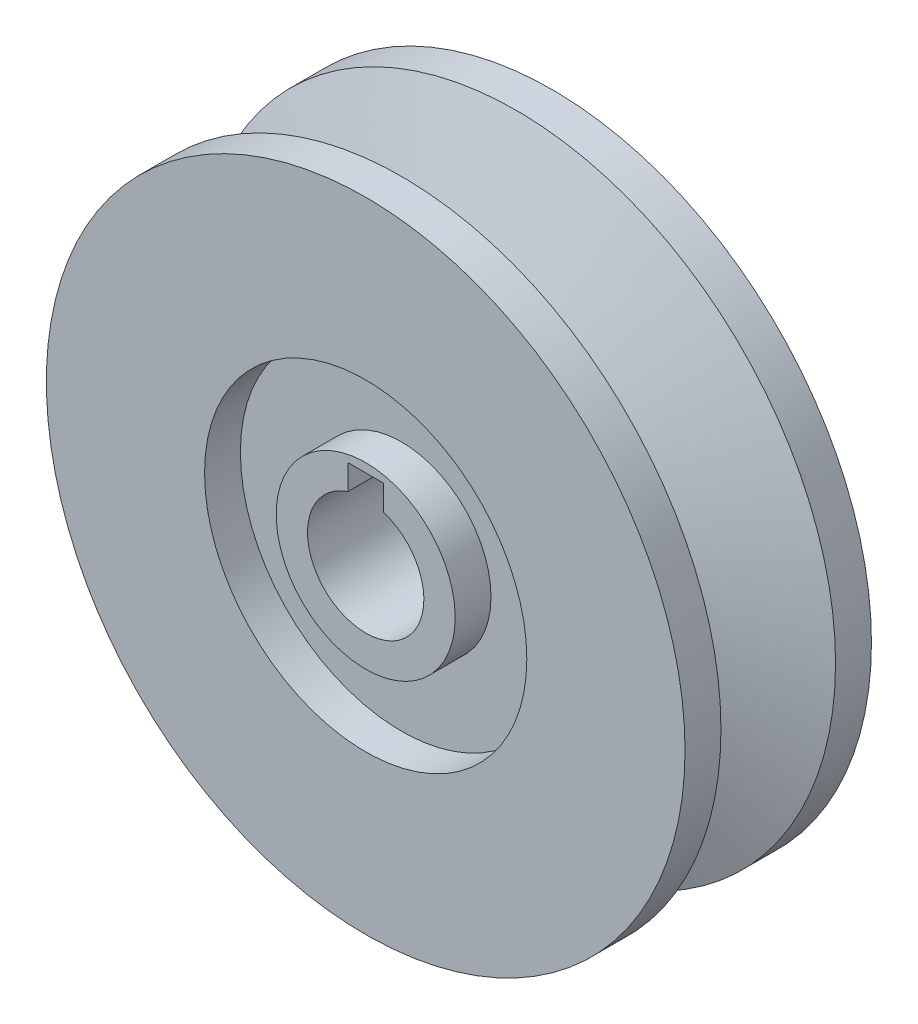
ISO-10303-21;
HEADER;
FILE_DESCRIPTION(('STEP AP214'),'2;1');
FILE_NAME('part.step','',(''),(''),'','','');
FILE_SCHEMA(('AUTOMOTIVE_DESIGN { 1 0 10303 214 1 1 1 1 }'));
ENDSEC;
DATA;
#1=APPLICATION_CONTEXT('core data for automotive mechanical design processes');
#2=APPLICATION_PROTOCOL_DEFINITION('international standard','automotive_design',2000,#1);
#3=PRODUCT_CONTEXT('',#1,'mechanical');
#4=PRODUCT('Part','Part','',(#3));
#5=PRODUCT_RELATED_PRODUCT_CATEGORY('part','',(#4));
#6=PRODUCT_DEFINITION_FORMATION('','',#4);
#7=PRODUCT_DEFINITION_CONTEXT('part definition',#1,'design');
#8=PRODUCT_DEFINITION('design','',#6,#7);
#9=PRODUCT_DEFINITION_SHAPE('','',#8);
#10=(LENGTH_UNIT() NAMED_UNIT(*) SI_UNIT(.MILLI.,.METRE.));
#11=(NAMED_UNIT(*) PLANE_ANGLE_UNIT() SI_UNIT($,.RADIAN.));
#12=(NAMED_UNIT(*) SI_UNIT($,.STERADIAN.) SOLID_ANGLE_UNIT());
#13=UNCERTAINTY_MEASURE_WITH_UNIT(LENGTH_MEASURE(1.E-05),#10,'distance_accuracy_value','');
#14=(GEOMETRIC_REPRESENTATION_CONTEXT(3) GLOBAL_UNCERTAINTY_ASSIGNED_CONTEXT((#13)) GLOBAL_UNIT_ASSIGNED_CONTEXT((#10,
#11,#12)) REPRESENTATION_CONTEXT('',''));
#15=CARTESIAN_POINT('',(0.,0.,0.));
#16=DIRECTION('',(0.,0.,1.));
#17=DIRECTION('',(1.,0.,0.));
#18=AXIS2_PLACEMENT_3D('',#15,#16,#17);
#19=CARTESIAN_POINT('',(0.,35.6749992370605,10.4139995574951));
#20=DIRECTION('',(0.,0.,-1.));
#21=DIRECTION('',(-1.,0.,0.));
#22=AXIS2_PLACEMENT_3D('',#19,#20,#21);
#23=PLANE('',#22);
#24=DIRECTION('',(0.,1.,0.));
#25=VECTOR('',#24,1.);
#26=CARTESIAN_POINT('',(-2.,9.00000000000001,10.4139995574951));
#27=LINE('',#26,#25);
#28=CARTESIAN_POINT('',(-2.,6.18465843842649,10.4139995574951));
#29=VERTEX_POINT('',#28);
#30=CARTESIAN_POINT('',(-2.,9.00000000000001,10.4139995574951));
#31=VERTEX_POINT('',#30);
#32=EDGE_CURVE('E80',#29,#31,#27,.T.);
#33=ORIENTED_EDGE('',*,*,#32,.T.);
#34=DIRECTION('',(1.,0.,0.));
#35=VECTOR('',#34,1.);
#36=CARTESIAN_POINT('',(2.,9.00000000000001,10.4139995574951));
#37=LINE('',#36,#35);
#38=CARTESIAN_POINT('',(2.,9.00000000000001,10.4139995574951));
#39=VERTEX_POINT('',#38);
#40=EDGE_CURVE('E74',#31,#39,#37,.T.);
#41=ORIENTED_EDGE('',*,*,#40,.T.);
#42=DIRECTION('',(0.,-1.,0.));
#43=VECTOR('',#42,1.);
#44=CARTESIAN_POINT('',(2.,9.00000000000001,10.4139995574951));
#45=LINE('',#44,#43);
#46=CARTESIAN_POINT('',(2.,6.18465843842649,10.4139995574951));
#47=VERTEX_POINT('',#46);
#48=EDGE_CURVE('E83',#39,#47,#45,.T.);
#49=ORIENTED_EDGE('',*,*,#48,.T.);
#50=CARTESIAN_POINT('',(0.,0.,10.4139995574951));
#51=DIRECTION('',(0.,0.,-1.));
#52=DIRECTION('',(-1.,0.,0.));
#53=AXIS2_PLACEMENT_3D('',#50,#51,#52);
#54=CIRCLE('',#53,6.5);
#55=EDGE_CURVE('E54',#47,#29,#54,.T.);
#56=ORIENTED_EDGE('',*,*,#55,.T.);
#57=EDGE_LOOP('',(#33,#41,#49,#56));
#58=FACE_BOUND('',#57,.T.);
#59=CARTESIAN_POINT('',(0.,0.,10.4139995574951));
#60=DIRECTION('',(0.,0.,1.));
#61=DIRECTION('',(1.,0.,0.));
#62=AXIS2_PLACEMENT_3D('',#59,#60,#61);
#63=CIRCLE('',#62,10.);
#64=CARTESIAN_POINT('',(10.,0.,10.4139995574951));
#65=VERTEX_POINT('',#64);
#66=EDGE_CURVE('E315',#65,#65,#63,.T.);
#67=ORIENTED_EDGE('',*,*,#66,.T.);
#68=EDGE_LOOP('',(#67));
#69=FACE_BOUND('',#68,.T.);
#70=ADVANCED_FACE('F31',(#58,#69),#23,.F.);
#71=CARTESIAN_POINT('',(0.,0.,-10.4139995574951));
#72=DIRECTION('',(0.,0.,1.));
#73=DIRECTION('',(1.,0.,0.));
#74=AXIS2_PLACEMENT_3D('',#71,#72,#73);
#75=PLANE('',#74);
#76=DIRECTION('',(0.,-1.,0.));
#77=VECTOR('',#76,1.);
#78=CARTESIAN_POINT('',(2.,9.00000000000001,-10.4139995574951));
#79=LINE('',#78,#77);
#80=CARTESIAN_POINT('',(2.,9.00000000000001,-10.4139995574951));
#81=VERTEX_POINT('',#80);
#82=CARTESIAN_POINT('',(2.,6.18465843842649,-10.4139995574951));
#83=VERTEX_POINT('',#82);
#84=EDGE_CURVE('E101',#81,#83,#79,.T.);
#85=ORIENTED_EDGE('',*,*,#84,.F.);
#86=DIRECTION('',(1.,0.,0.));
#87=VECTOR('',#86,1.);
#88=CARTESIAN_POINT('',(2.,9.00000000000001,-10.4139995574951));
#89=LINE('',#88,#87);
#90=CARTESIAN_POINT('',(-2.,9.00000000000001,-10.4139995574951));
#91=VERTEX_POINT('',#90);
#92=EDGE_CURVE('E46',#91,#81,#89,.T.);
#93=ORIENTED_EDGE('',*,*,#92,.F.);
#94=DIRECTION('',(0.,1.,0.));
#95=VECTOR('',#94,1.);
#96=CARTESIAN_POINT('',(-2.,9.00000000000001,-10.4139995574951));
#97=LINE('',#96,#95);
#98=CARTESIAN_POINT('',(-2.,6.18465843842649,-10.4139995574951));
#99=VERTEX_POINT('',#98);
#100=EDGE_CURVE('E89',#99,#91,#97,.T.);
#101=ORIENTED_EDGE('',*,*,#100,.F.);
#102=CARTESIAN_POINT('',(0.,0.,-10.4139995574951));
#103=DIRECTION('',(0.,0.,-1.));
#104=DIRECTION('',(-1.,0.,0.));
#105=AXIS2_PLACEMENT_3D('',#102,#103,#104);
#106=CIRCLE('',#105,6.5);
#107=EDGE_CURVE('E92',#83,#99,#106,.T.);
#108=ORIENTED_EDGE('',*,*,#107,.F.);
#109=EDGE_LOOP('',(#85,#93,#101,#108));
#110=FACE_BOUND('',#109,.T.);
#111=CARTESIAN_POINT('',(0.,0.,-10.4139995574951));
#112=DIRECTION('',(0.,0.,-1.));
#113=DIRECTION('',(-1.,0.,0.));
#114=AXIS2_PLACEMENT_3D('',#111,#112,#113);
#115=CIRCLE('',#114,10.);
#116=CARTESIAN_POINT('',(-10.,0.,-10.4139995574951));
#117=VERTEX_POINT('',#116);
#118=EDGE_CURVE('E322',#117,#117,#115,.T.);
#119=ORIENTED_EDGE('',*,*,#118,.T.);
#120=EDGE_LOOP('',(#119));
#121=FACE_BOUND('',#120,.T.);
#122=ADVANCED_FACE('F133',(#110,#121),#75,.F.);
#123=CARTESIAN_POINT('',(0.,0.,-10.4139995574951));
#124=DIRECTION('',(0.,0.,-1.));
#125=DIRECTION('',(-1.,0.,0.));
#126=AXIS2_PLACEMENT_3D('',#123,#124,#125);
#127=CIRCLE('',#126,18.);
#128=CARTESIAN_POINT('',(-18.,0.,-10.4139995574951));
#129=VERTEX_POINT('',#128);
#130=EDGE_CURVE('E95',#129,#129,#127,.T.);
#131=ORIENTED_EDGE('',*,*,#130,.F.);
#132=EDGE_LOOP('',(#131));
#133=FACE_BOUND('',#132,.T.);
#134=CARTESIAN_POINT('',(0.,0.,-10.4139995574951));
#135=DIRECTION('',(0.,0.,1.));
#136=DIRECTION('',(1.,0.,0.));
#137=AXIS2_PLACEMENT_3D('',#134,#135,#136);
#138=CIRCLE('',#137,35.6749992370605);
#139=CARTESIAN_POINT('',(35.6749992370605,0.,-10.4139995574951));
#140=VERTEX_POINT('',#139);
#141=EDGE_CURVE('E11',#140,#140,#138,.T.);
#142=ORIENTED_EDGE('',*,*,#141,.F.);
#143=EDGE_LOOP('',(#142));
#144=FACE_BOUND('',#143,.T.);
#145=ADVANCED_FACE('F33',(#133,#144),#75,.F.);
#146=CARTESIAN_POINT('',(0.,0.,20.8279991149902));
#147=DIRECTION('',(0.,0.,1.));
#148=DIRECTION('',(1.,0.,0.));
#149=AXIS2_PLACEMENT_3D('',#146,#147,#148);
#150=CYLINDRICAL_SURFACE('',#149,35.6749992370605);
#151=CARTESIAN_POINT('',(0.,0.,-6.4008002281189));
#152=DIRECTION('',(0.,0.,1.));
#153=DIRECTION('',(1.,0.,0.));
#154=AXIS2_PLACEMENT_3D('',#151,#152,#153);
#155=CIRCLE('',#154,35.6749992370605);
#156=CARTESIAN_POINT('',(35.6749992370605,0.,-6.4008002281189));
#157=VERTEX_POINT('',#156);
#158=EDGE_CURVE('E39',#157,#157,#155,.T.);
#159=ORIENTED_EDGE('',*,*,#158,.F.);
#160=EDGE_LOOP('',(#159));
#161=FACE_BOUND('',#160,.T.);
#162=ORIENTED_EDGE('',*,*,#141,.T.);
#163=EDGE_LOOP('',(#162));
#164=FACE_BOUND('',#163,.T.);
#165=ADVANCED_FACE('F127',(#161,#164),#150,.T.);
#166=CARTESIAN_POINT('',(0.,0.,-6.4008002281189));
#167=DIRECTION('',(0.,0.,-1.));
#168=DIRECTION('',(-1.,0.,0.));
#169=AXIS2_PLACEMENT_3D('',#166,#167,#168);
#170=CONICAL_SURFACE('',#169,35.6749992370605,1.23918377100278);
#171=CARTESIAN_POINT('',(0.,0.,-2.11529874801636));
#172=DIRECTION('',(0.,0.,1.));
#173=DIRECTION('',(1.,0.,0.));
#174=AXIS2_PLACEMENT_3D('',#171,#172,#173);
#175=CIRCLE('',#174,23.2289991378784);
#176=CARTESIAN_POINT('',(23.2289991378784,0.,-2.11529874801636));
#177=VERTEX_POINT('',#176);
#178=EDGE_CURVE('E120',#177,#177,#175,.T.);
#179=ORIENTED_EDGE('',*,*,#178,.F.);
#180=EDGE_LOOP('',(#179));
#181=FACE_BOUND('',#180,.T.);
#182=ORIENTED_EDGE('',*,*,#158,.T.);
#183=EDGE_LOOP('',(#182));
#184=FACE_BOUND('',#183,.T.);
#185=ADVANCED_FACE('F125',(#181,#184),#170,.T.);
#186=CARTESIAN_POINT('',(0.,0.,20.8279991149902));
#187=DIRECTION('',(0.,0.,1.));
#188=DIRECTION('',(1.,0.,0.));
#189=AXIS2_PLACEMENT_3D('',#186,#187,#188);
#190=CYLINDRICAL_SURFACE('',#189,23.2289991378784);
#191=CARTESIAN_POINT('',(0.,0.,2.11529874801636));
#192=DIRECTION('',(0.,0.,1.));
#193=DIRECTION('',(1.,0.,0.));
#194=AXIS2_PLACEMENT_3D('',#191,#192,#193);
#195=CIRCLE('',#194,23.2289991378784);
#196=CARTESIAN_POINT('',(23.2289991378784,0.,2.11529874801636));
#197=VERTEX_POINT('',#196);
#198=EDGE_CURVE('E117',#197,#197,#195,.T.);
#199=ORIENTED_EDGE('',*,*,#198,.F.);
#200=EDGE_LOOP('',(#199));
#201=FACE_BOUND('',#200,.T.);
#202=ORIENTED_EDGE('',*,*,#178,.T.);
#203=EDGE_LOOP('',(#202));
#204=FACE_BOUND('',#203,.T.);
#205=ADVANCED_FACE('F167',(#201,#204),#190,.T.);
#206=CARTESIAN_POINT('',(0.,0.,2.11529874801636));
#207=DIRECTION('',(0.,0.,1.));
#208=DIRECTION('',(1.,0.,0.));
#209=AXIS2_PLACEMENT_3D('',#206,#207,#208);
#210=CONICAL_SURFACE('',#209,23.2289991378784,1.23918377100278);
#211=CARTESIAN_POINT('',(0.,0.,6.4008002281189));
#212=DIRECTION('',(0.,0.,1.));
#213=DIRECTION('',(1.,0.,0.));
#214=AXIS2_PLACEMENT_3D('',#211,#212,#213);
#215=CIRCLE('',#214,35.6749992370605);
#216=CARTESIAN_POINT('',(35.6749992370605,0.,6.4008002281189));
#217=VERTEX_POINT('',#216);
#218=EDGE_CURVE('E114',#217,#217,#215,.T.);
#219=ORIENTED_EDGE('',*,*,#218,.F.);
#220=EDGE_LOOP('',(#219));
#221=FACE_BOUND('',#220,.T.);
#222=ORIENTED_EDGE('',*,*,#198,.T.);
#223=EDGE_LOOP('',(#222));
#224=FACE_BOUND('',#223,.T.);
#225=ADVANCED_FACE('F155',(#221,#224),#210,.T.);
#226=CARTESIAN_POINT('',(0.,0.,20.8279991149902));
#227=DIRECTION('',(0.,0.,1.));
#228=DIRECTION('',(1.,0.,0.));
#229=AXIS2_PLACEMENT_3D('',#226,#227,#228);
#230=CYLINDRICAL_SURFACE('',#229,35.6749992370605);
#231=CARTESIAN_POINT('',(0.,0.,10.4139995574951));
#232=DIRECTION('',(0.,0.,1.));
#233=DIRECTION('',(1.,0.,0.));
#234=AXIS2_PLACEMENT_3D('',#231,#232,#233);
#235=CIRCLE('',#234,35.6749992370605);
#236=CARTESIAN_POINT('',(35.6749992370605,0.,10.4139995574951));
#237=VERTEX_POINT('',#236);
#238=EDGE_CURVE('E108',#237,#237,#235,.T.);
#239=ORIENTED_EDGE('',*,*,#238,.F.);
#240=EDGE_LOOP('',(#239));
#241=FACE_BOUND('',#240,.T.);
#242=ORIENTED_EDGE('',*,*,#218,.T.);
#243=EDGE_LOOP('',(#242));
#244=FACE_BOUND('',#243,.T.);
#245=ADVANCED_FACE('F148',(#241,#244),#230,.T.);
#246=CARTESIAN_POINT('',(0.,0.,10.4139995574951));
#247=DIRECTION('',(0.,0.,1.));
#248=DIRECTION('',(1.,0.,0.));
#249=AXIS2_PLACEMENT_3D('',#246,#247,#248);
#250=CIRCLE('',#249,18.);
#251=CARTESIAN_POINT('',(18.,0.,10.4139995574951));
#252=VERTEX_POINT('',#251);
#253=EDGE_CURVE('E160',#252,#252,#250,.T.);
#254=ORIENTED_EDGE('',*,*,#253,.F.);
#255=EDGE_LOOP('',(#254));
#256=FACE_BOUND('',#255,.T.);
#257=ORIENTED_EDGE('',*,*,#238,.T.);
#258=EDGE_LOOP('',(#257));
#259=FACE_BOUND('',#258,.T.);
#260=ADVANCED_FACE('F142',(#256,#259),#23,.F.);
#261=CARTESIAN_POINT('',(2.,9.00000000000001,10.4139995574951));
#262=DIRECTION('',(0.,1.,0.));
#263=DIRECTION('',(0.,0.,1.));
#264=AXIS2_PLACEMENT_3D('',#261,#262,#263);
#265=PLANE('',#264);
#266=ORIENTED_EDGE('',*,*,#92,.T.);
#267=DIRECTION('',(0.,0.,-1.));
#268=VECTOR('',#267,1.);
#269=CARTESIAN_POINT('',(2.,9.00000000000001,10.4139995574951));
#270=LINE('',#269,#268);
#271=EDGE_CURVE('E70',#39,#81,#270,.T.);
#272=ORIENTED_EDGE('',*,*,#271,.F.);
#273=ORIENTED_EDGE('',*,*,#40,.F.);
#274=DIRECTION('',(0.,0.,-1.));
#275=VECTOR('',#274,1.);
#276=CARTESIAN_POINT('',(-2.,9.00000000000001,10.4139995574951));
#277=LINE('',#276,#275);
#278=EDGE_CURVE('E106',#31,#91,#277,.T.);
#279=ORIENTED_EDGE('',*,*,#278,.T.);
#280=EDGE_LOOP('',(#266,#272,#273,#279));
#281=FACE_BOUND('',#280,.T.);
#282=ADVANCED_FACE('F72',(#281),#265,.F.);
#283=CARTESIAN_POINT('',(-2.,9.00000000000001,10.4139995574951));
#284=DIRECTION('',(-1.,0.,0.));
#285=DIRECTION('',(0.,0.,1.));
#286=AXIS2_PLACEMENT_3D('',#283,#284,#285);
#287=PLANE('',#286);
#288=ORIENTED_EDGE('',*,*,#100,.T.);
#289=ORIENTED_EDGE('',*,*,#278,.F.);
#290=ORIENTED_EDGE('',*,*,#32,.F.);
#291=DIRECTION('',(0.,0.,-1.));
#292=VECTOR('',#291,1.);
#293=CARTESIAN_POINT('',(-2.,6.18465843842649,10.4139995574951));
#294=LINE('',#293,#292);
#295=EDGE_CURVE('E109',#29,#99,#294,.T.);
#296=ORIENTED_EDGE('',*,*,#295,.T.);
#297=EDGE_LOOP('',(#288,#289,#290,#296));
#298=FACE_BOUND('',#297,.T.);
#299=ADVANCED_FACE('F154',(#298),#287,.F.);
#300=CARTESIAN_POINT('',(0.,0.,10.4139995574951));
#301=DIRECTION('',(0.,0.,-1.));
#302=DIRECTION('',(-1.,0.,0.));
#303=AXIS2_PLACEMENT_3D('',#300,#301,#302);
#304=CYLINDRICAL_SURFACE('',#303,6.5);
#305=ORIENTED_EDGE('',*,*,#107,.T.);
#306=ORIENTED_EDGE('',*,*,#295,.F.);
#307=ORIENTED_EDGE('',*,*,#55,.F.);
#308=DIRECTION('',(0.,0.,-1.));
#309=VECTOR('',#308,1.);
#310=CARTESIAN_POINT('',(2.,6.18465843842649,10.4139995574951));
#311=LINE('',#310,#309);
#312=EDGE_CURVE('E79',#47,#83,#311,.T.);
#313=ORIENTED_EDGE('',*,*,#312,.T.);
#314=EDGE_LOOP('',(#305,#306,#307,#313));
#315=FACE_BOUND('',#314,.T.);
#316=ADVANCED_FACE('F210',(#315),#304,.F.);
#317=CARTESIAN_POINT('',(2.,9.00000000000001,10.4139995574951));
#318=DIRECTION('',(1.,0.,0.));
#319=DIRECTION('',(0.,0.,-1.));
#320=AXIS2_PLACEMENT_3D('',#317,#318,#319);
#321=PLANE('',#320);
#322=ORIENTED_EDGE('',*,*,#84,.T.);
#323=ORIENTED_EDGE('',*,*,#312,.F.);
#324=ORIENTED_EDGE('',*,*,#48,.F.);
#325=ORIENTED_EDGE('',*,*,#271,.T.);
#326=EDGE_LOOP('',(#322,#323,#324,#325));
#327=FACE_BOUND('',#326,.T.);
#328=ADVANCED_FACE('F84',(#327),#321,.F.);
#329=CARTESIAN_POINT('',(0.,0.,-6.41399955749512));
#330=DIRECTION('',(0.,0.,-1.));
#331=DIRECTION('',(-1.,0.,0.));
#332=AXIS2_PLACEMENT_3D('',#329,#330,#331);
#333=CYLINDRICAL_SURFACE('',#332,18.);
#334=CARTESIAN_POINT('',(0.,0.,-6.41399955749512));
#335=DIRECTION('',(0.,0.,-1.));
#336=DIRECTION('',(-1.,0.,0.));
#337=AXIS2_PLACEMENT_3D('',#334,#335,#336);
#338=CIRCLE('',#337,18.);
#339=CARTESIAN_POINT('',(-18.,0.,-6.41399955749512));
#340=VERTEX_POINT('',#339);
#341=EDGE_CURVE('E102',#340,#340,#338,.T.);
#342=ORIENTED_EDGE('',*,*,#341,.F.);
#343=EDGE_LOOP('',(#342));
#344=FACE_BOUND('',#343,.T.);
#345=ORIENTED_EDGE('',*,*,#130,.T.);
#346=EDGE_LOOP('',(#345));
#347=FACE_BOUND('',#346,.T.);
#348=ADVANCED_FACE('F228',(#344,#347),#333,.F.);
#349=CARTESIAN_POINT('',(0.,0.,-6.41399955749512));
#350=DIRECTION('',(0.,0.,-1.));
#351=DIRECTION('',(-1.,0.,0.));
#352=AXIS2_PLACEMENT_3D('',#349,#350,#351);
#353=PLANE('',#352);
#354=CARTESIAN_POINT('',(0.,0.,-6.41399955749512));
#355=DIRECTION('',(0.,0.,-1.));
#356=DIRECTION('',(-1.,0.,0.));
#357=AXIS2_PLACEMENT_3D('',#354,#355,#356);
#358=CIRCLE('',#357,10.);
#359=CARTESIAN_POINT('',(-10.,0.,-6.41399955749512));
#360=VERTEX_POINT('',#359);
#361=EDGE_CURVE('E324',#360,#360,#358,.T.);
#362=ORIENTED_EDGE('',*,*,#361,.F.);
#363=EDGE_LOOP('',(#362));
#364=FACE_BOUND('',#363,.T.);
#365=ORIENTED_EDGE('',*,*,#341,.T.);
#366=EDGE_LOOP('',(#365));
#367=FACE_BOUND('',#366,.T.);
#368=ADVANCED_FACE('F248',(#364,#367),#353,.T.);
#369=CARTESIAN_POINT('',(0.,0.,-6.41399955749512));
#370=DIRECTION('',(0.,0.,-1.));
#371=DIRECTION('',(-1.,0.,0.));
#372=AXIS2_PLACEMENT_3D('',#369,#370,#371);
#373=CYLINDRICAL_SURFACE('',#372,10.);
#374=ORIENTED_EDGE('',*,*,#361,.T.);
#375=EDGE_LOOP('',(#374));
#376=FACE_BOUND('',#375,.T.);
#377=ORIENTED_EDGE('',*,*,#118,.F.);
#378=EDGE_LOOP('',(#377));
#379=FACE_BOUND('',#378,.T.);
#380=ADVANCED_FACE('F258',(#376,#379),#373,.T.);
#381=CARTESIAN_POINT('',(0.,0.,6.41399955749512));
#382=DIRECTION('',(0.,0.,1.));
#383=DIRECTION('',(1.,0.,0.));
#384=AXIS2_PLACEMENT_3D('',#381,#382,#383);
#385=CYLINDRICAL_SURFACE('',#384,18.);
#386=CARTESIAN_POINT('',(0.,0.,6.41399955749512));
#387=DIRECTION('',(0.,0.,1.));
#388=DIRECTION('',(1.,0.,0.));
#389=AXIS2_PLACEMENT_3D('',#386,#387,#388);
#390=CIRCLE('',#389,18.);
#391=CARTESIAN_POINT('',(18.,0.,6.41399955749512));
#392=VERTEX_POINT('',#391);
#393=EDGE_CURVE('E319',#392,#392,#390,.T.);
#394=ORIENTED_EDGE('',*,*,#393,.F.);
#395=EDGE_LOOP('',(#394));
#396=FACE_BOUND('',#395,.T.);
#397=ORIENTED_EDGE('',*,*,#253,.T.);
#398=EDGE_LOOP('',(#397));
#399=FACE_BOUND('',#398,.T.);
#400=ADVANCED_FACE('F267',(#396,#399),#385,.F.);
#401=CARTESIAN_POINT('',(0.,0.,6.41399955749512));
#402=DIRECTION('',(0.,0.,1.));
#403=DIRECTION('',(1.,0.,0.));
#404=AXIS2_PLACEMENT_3D('',#401,#402,#403);
#405=PLANE('',#404);
#406=CARTESIAN_POINT('',(0.,0.,6.41399955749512));
#407=DIRECTION('',(0.,0.,1.));
#408=DIRECTION('',(1.,0.,0.));
#409=AXIS2_PLACEMENT_3D('',#406,#407,#408);
#410=CIRCLE('',#409,10.);
#411=CARTESIAN_POINT('',(10.,0.,6.41399955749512));
#412=VERTEX_POINT('',#411);
#413=EDGE_CURVE('E312',#412,#412,#410,.T.);
#414=ORIENTED_EDGE('',*,*,#413,.F.);
#415=EDGE_LOOP('',(#414));
#416=FACE_BOUND('',#415,.T.);
#417=ORIENTED_EDGE('',*,*,#393,.T.);
#418=EDGE_LOOP('',(#417));
#419=FACE_BOUND('',#418,.T.);
#420=ADVANCED_FACE('F285',(#416,#419),#405,.T.);
#421=CARTESIAN_POINT('',(0.,0.,6.41399955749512));
#422=DIRECTION('',(0.,0.,1.));
#423=DIRECTION('',(1.,0.,0.));
#424=AXIS2_PLACEMENT_3D('',#421,#422,#423);
#425=CYLINDRICAL_SURFACE('',#424,10.);
#426=ORIENTED_EDGE('',*,*,#413,.T.);
#427=EDGE_LOOP('',(#426));
#428=FACE_BOUND('',#427,.T.);
#429=ORIENTED_EDGE('',*,*,#66,.F.);
#430=EDGE_LOOP('',(#429));
#431=FACE_BOUND('',#430,.T.);
#432=ADVANCED_FACE('F295',(#428,#431),#425,.T.);
#433=CLOSED_SHELL('',(#70,#122,#145,#165,#185,#205,#225,#245,#260,#282,#299,#316,#328,#348,#368,
#380,#400,#420,#432));
#434=MANIFOLD_SOLID_BREP('B2',#433);
#435=ADVANCED_BREP_SHAPE_REPRESENTATION('',(#18,#434),#14);
#436=SHAPE_DEFINITION_REPRESENTATION(#9,#435);
ENDSEC;
END-ISO-10303-21;
